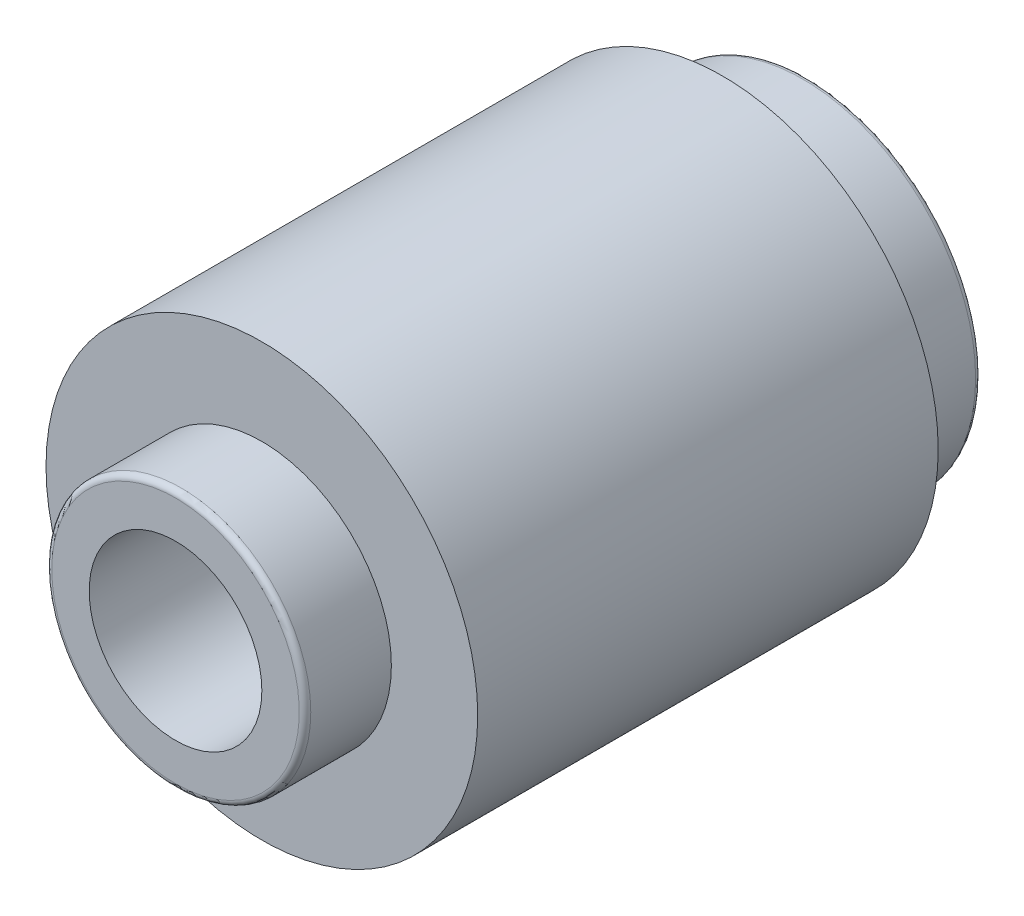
ISO-10303-21;
HEADER;
FILE_DESCRIPTION(('STEP AP214'),'2;1');
FILE_NAME('part.step','',(''),(''),'','','');
FILE_SCHEMA(('AUTOMOTIVE_DESIGN { 1 0 10303 214 1 1 1 1 }'));
ENDSEC;
DATA;
#1=APPLICATION_CONTEXT('core data for automotive mechanical design processes');
#2=APPLICATION_PROTOCOL_DEFINITION('international standard','automotive_design',2000,#1);
#3=PRODUCT_CONTEXT('',#1,'mechanical');
#4=PRODUCT('Part','Part','',(#3));
#5=PRODUCT_RELATED_PRODUCT_CATEGORY('part','',(#4));
#6=PRODUCT_DEFINITION_FORMATION('','',#4);
#7=PRODUCT_DEFINITION_CONTEXT('part definition',#1,'design');
#8=PRODUCT_DEFINITION('design','',#6,#7);
#9=PRODUCT_DEFINITION_SHAPE('','',#8);
#10=(LENGTH_UNIT() NAMED_UNIT(*) SI_UNIT(.MILLI.,.METRE.));
#11=(NAMED_UNIT(*) PLANE_ANGLE_UNIT() SI_UNIT($,.RADIAN.));
#12=(NAMED_UNIT(*) SI_UNIT($,.STERADIAN.) SOLID_ANGLE_UNIT());
#13=UNCERTAINTY_MEASURE_WITH_UNIT(LENGTH_MEASURE(1.E-05),#10,'distance_accuracy_value','');
#14=(GEOMETRIC_REPRESENTATION_CONTEXT(3) GLOBAL_UNCERTAINTY_ASSIGNED_CONTEXT((#13)) GLOBAL_UNIT_ASSIGNED_CONTEXT((#10,
#11,#12)) REPRESENTATION_CONTEXT('',''));
#15=CARTESIAN_POINT('',(0.,0.,0.));
#16=DIRECTION('',(0.,0.,1.));
#17=DIRECTION('',(1.,0.,0.));
#18=AXIS2_PLACEMENT_3D('',#15,#16,#17);
#19=CARTESIAN_POINT('',(0.,3.75,3.49252275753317));
#20=DIRECTION('',(0.,0.,-1.));
#21=DIRECTION('',(-1.,0.,0.));
#22=AXIS2_PLACEMENT_3D('',#19,#20,#21);
#23=PLANE('',#22);
#24=CARTESIAN_POINT('',(0.,0.,3.49252275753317));
#25=DIRECTION('',(0.,0.,1.));
#26=DIRECTION('',(1.,0.,0.));
#27=AXIS2_PLACEMENT_3D('',#24,#25,#26);
#28=CIRCLE('',#27,2.25);
#29=CARTESIAN_POINT('',(2.25,0.,3.49252275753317));
#30=VERTEX_POINT('',#29);
#31=EDGE_CURVE('E71',#30,#30,#28,.T.);
#32=ORIENTED_EDGE('',*,*,#31,.F.);
#33=EDGE_LOOP('',(#32));
#34=FACE_BOUND('',#33,.T.);
#35=CARTESIAN_POINT('',(0.,0.,3.49252275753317));
#36=DIRECTION('',(0.,0.,1.));
#37=DIRECTION('',(1.,0.,0.));
#38=AXIS2_PLACEMENT_3D('',#35,#36,#37);
#39=CIRCLE('',#38,3.75);
#40=CARTESIAN_POINT('',(3.75,0.,3.49252275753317));
#41=VERTEX_POINT('',#40);
#42=EDGE_CURVE('E50',#41,#41,#39,.T.);
#43=ORIENTED_EDGE('',*,*,#42,.T.);
#44=EDGE_LOOP('',(#43));
#45=FACE_BOUND('',#44,.T.);
#46=ADVANCED_FACE('F30',(#34,#45),#23,.F.);
#47=CARTESIAN_POINT('',(0.,0.,21.3614343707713));
#48=DIRECTION('',(0.,0.,1.));
#49=DIRECTION('',(1.,0.,0.));
#50=AXIS2_PLACEMENT_3D('',#47,#48,#49);
#51=CYLINDRICAL_SURFACE('',#50,3.75);
#52=ORIENTED_EDGE('',*,*,#42,.F.);
#53=EDGE_LOOP('',(#52));
#54=FACE_BOUND('',#53,.T.);
#55=CARTESIAN_POINT('',(0.,0.,-4.50747724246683));
#56=DIRECTION('',(0.,0.,1.));
#57=DIRECTION('',(1.,0.,0.));
#58=AXIS2_PLACEMENT_3D('',#55,#56,#57);
#59=CIRCLE('',#58,3.75);
#60=CARTESIAN_POINT('',(3.75,0.,-4.50747724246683));
#61=VERTEX_POINT('',#60);
#62=EDGE_CURVE('E53',#61,#61,#59,.T.);
#63=ORIENTED_EDGE('',*,*,#62,.T.);
#64=EDGE_LOOP('',(#63));
#65=FACE_BOUND('',#64,.T.);
#66=ADVANCED_FACE('F79',(#54,#65),#51,.T.);
#67=CARTESIAN_POINT('',(0.,3.75,-4.50747724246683));
#68=DIRECTION('',(0.,0.,1.));
#69=DIRECTION('',(1.,0.,0.));
#70=AXIS2_PLACEMENT_3D('',#67,#68,#69);
#71=PLANE('',#70);
#72=ORIENTED_EDGE('',*,*,#62,.F.);
#73=EDGE_LOOP('',(#72));
#74=FACE_BOUND('',#73,.T.);
#75=CARTESIAN_POINT('',(0.,0.,-4.50747724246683));
#76=DIRECTION('',(0.,0.,1.));
#77=DIRECTION('',(1.,0.,0.));
#78=AXIS2_PLACEMENT_3D('',#75,#76,#77);
#79=CIRCLE('',#78,3.);
#80=CARTESIAN_POINT('',(3.,0.,-4.50747724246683));
#81=VERTEX_POINT('',#80);
#82=EDGE_CURVE('E56',#81,#81,#79,.T.);
#83=ORIENTED_EDGE('',*,*,#82,.T.);
#84=EDGE_LOOP('',(#83));
#85=FACE_BOUND('',#84,.T.);
#86=ADVANCED_FACE('F85',(#74,#85),#71,.F.);
#87=CARTESIAN_POINT('',(0.,0.,21.3614343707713));
#88=DIRECTION('',(0.,0.,1.));
#89=DIRECTION('',(1.,0.,0.));
#90=AXIS2_PLACEMENT_3D('',#87,#88,#89);
#91=CYLINDRICAL_SURFACE('',#90,3.);
#92=CARTESIAN_POINT('',(0.,0.,-5.90747724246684));
#93=DIRECTION('',(0.,0.,1.));
#94=DIRECTION('',(1.,0.,0.));
#95=AXIS2_PLACEMENT_3D('',#92,#93,#94);
#96=CIRCLE('',#95,3.);
#97=CARTESIAN_POINT('',(3.,0.,-5.90747724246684));
#98=VERTEX_POINT('',#97);
#99=EDGE_CURVE('E45',#98,#98,#96,.T.);
#100=ORIENTED_EDGE('',*,*,#99,.T.);
#101=EDGE_LOOP('',(#100));
#102=FACE_BOUND('',#101,.T.);
#103=ORIENTED_EDGE('',*,*,#82,.F.);
#104=EDGE_LOOP('',(#103));
#105=FACE_BOUND('',#104,.T.);
#106=ADVANCED_FACE('F91',(#102,#105),#91,.T.);
#107=CARTESIAN_POINT('',(0.,3.,-6.00747724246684));
#108=DIRECTION('',(0.,0.,1.));
#109=DIRECTION('',(1.,0.,0.));
#110=AXIS2_PLACEMENT_3D('',#107,#108,#109);
#111=PLANE('',#110);
#112=CARTESIAN_POINT('',(0.,0.,-6.00747724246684));
#113=DIRECTION('',(0.,0.,1.));
#114=DIRECTION('',(1.,0.,0.));
#115=AXIS2_PLACEMENT_3D('',#112,#113,#114);
#116=CIRCLE('',#115,2.9);
#117=CARTESIAN_POINT('',(2.9,0.,-6.00747724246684));
#118=VERTEX_POINT('',#117);
#119=EDGE_CURVE('E41',#118,#118,#116,.F.);
#120=ORIENTED_EDGE('',*,*,#119,.T.);
#121=EDGE_LOOP('',(#120));
#122=FACE_BOUND('',#121,.T.);
#123=CARTESIAN_POINT('',(0.,0.,-6.00747724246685));
#124=DIRECTION('',(0.,0.,1.));
#125=DIRECTION('',(1.,0.,0.));
#126=AXIS2_PLACEMENT_3D('',#123,#124,#125);
#127=CIRCLE('',#126,2.25000000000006);
#128=CARTESIAN_POINT('',(2.25000000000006,0.,-6.00747724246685));
#129=VERTEX_POINT('',#128);
#130=EDGE_CURVE('E59',#129,#129,#127,.T.);
#131=ORIENTED_EDGE('',*,*,#130,.T.);
#132=EDGE_LOOP('',(#131));
#133=FACE_BOUND('',#132,.T.);
#134=ADVANCED_FACE('F96',(#122,#133),#111,.F.);
#135=CARTESIAN_POINT('',(0.,0.,21.3614343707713));
#136=DIRECTION('',(0.,0.,1.));
#137=DIRECTION('',(1.,0.,0.));
#138=AXIS2_PLACEMENT_3D('',#135,#136,#137);
#139=CYLINDRICAL_SURFACE('',#138,2.25000000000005);
#140=ORIENTED_EDGE('',*,*,#130,.F.);
#141=EDGE_LOOP('',(#140));
#142=FACE_BOUND('',#141,.T.);
#143=CARTESIAN_POINT('',(0.,0.,2.49252275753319));
#144=DIRECTION('',(0.,0.,1.));
#145=DIRECTION('',(1.,0.,0.));
#146=AXIS2_PLACEMENT_3D('',#143,#144,#145);
#147=CIRCLE('',#146,2.25000000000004);
#148=CARTESIAN_POINT('',(2.25000000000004,0.,2.49252275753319));
#149=VERTEX_POINT('',#148);
#150=EDGE_CURVE('E62',#149,#149,#147,.T.);
#151=ORIENTED_EDGE('',*,*,#150,.T.);
#152=EDGE_LOOP('',(#151));
#153=FACE_BOUND('',#152,.T.);
#154=ADVANCED_FACE('F102',(#142,#153),#139,.F.);
#155=CARTESIAN_POINT('',(0.,1.5,2.49252275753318));
#156=DIRECTION('',(0.,0.,1.));
#157=DIRECTION('',(1.,0.,0.));
#158=AXIS2_PLACEMENT_3D('',#155,#156,#157);
#159=PLANE('',#158);
#160=ORIENTED_EDGE('',*,*,#150,.F.);
#161=EDGE_LOOP('',(#160));
#162=FACE_BOUND('',#161,.T.);
#163=CARTESIAN_POINT('',(0.,0.,2.49252275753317));
#164=DIRECTION('',(0.,0.,1.));
#165=DIRECTION('',(1.,0.,0.));
#166=AXIS2_PLACEMENT_3D('',#163,#164,#165);
#167=CIRCLE('',#166,1.5);
#168=CARTESIAN_POINT('',(1.5,0.,2.49252275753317));
#169=VERTEX_POINT('',#168);
#170=EDGE_CURVE('E65',#169,#169,#167,.T.);
#171=ORIENTED_EDGE('',*,*,#170,.T.);
#172=EDGE_LOOP('',(#171));
#173=FACE_BOUND('',#172,.T.);
#174=ADVANCED_FACE('F124',(#162,#173),#159,.F.);
#175=CARTESIAN_POINT('',(0.,0.,21.3614343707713));
#176=DIRECTION('',(0.,0.,1.));
#177=DIRECTION('',(1.,0.,0.));
#178=AXIS2_PLACEMENT_3D('',#175,#176,#177);
#179=CYLINDRICAL_SURFACE('',#178,1.5);
#180=ORIENTED_EDGE('',*,*,#170,.F.);
#181=EDGE_LOOP('',(#180));
#182=FACE_BOUND('',#181,.T.);
#183=CARTESIAN_POINT('',(0.,0.,4.99252275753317));
#184=DIRECTION('',(0.,0.,1.));
#185=DIRECTION('',(1.,0.,0.));
#186=AXIS2_PLACEMENT_3D('',#183,#184,#185);
#187=CIRCLE('',#186,1.5);
#188=CARTESIAN_POINT('',(1.5,0.,4.99252275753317));
#189=VERTEX_POINT('',#188);
#190=EDGE_CURVE('E68',#189,#189,#187,.T.);
#191=ORIENTED_EDGE('',*,*,#190,.T.);
#192=EDGE_LOOP('',(#191));
#193=FACE_BOUND('',#192,.T.);
#194=ADVANCED_FACE('F129',(#182,#193),#179,.F.);
#195=CARTESIAN_POINT('',(0.,2.25,4.99252275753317));
#196=DIRECTION('',(0.,0.,-1.));
#197=DIRECTION('',(-1.,0.,0.));
#198=AXIS2_PLACEMENT_3D('',#195,#196,#197);
#199=PLANE('',#198);
#200=CARTESIAN_POINT('',(0.,0.,4.99252275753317));
#201=DIRECTION('',(0.,0.,-1.));
#202=DIRECTION('',(-1.,0.,0.));
#203=AXIS2_PLACEMENT_3D('',#200,#201,#202);
#204=CIRCLE('',#203,2.15);
#205=CARTESIAN_POINT('',(-2.15,0.,4.99252275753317));
#206=VERTEX_POINT('',#205);
#207=EDGE_CURVE('E37',#206,#206,#204,.F.);
#208=ORIENTED_EDGE('',*,*,#207,.T.);
#209=EDGE_LOOP('',(#208));
#210=FACE_BOUND('',#209,.T.);
#211=ORIENTED_EDGE('',*,*,#190,.F.);
#212=EDGE_LOOP('',(#211));
#213=FACE_BOUND('',#212,.T.);
#214=ADVANCED_FACE('F114',(#210,#213),#199,.F.);
#215=CARTESIAN_POINT('',(0.,0.,21.3614343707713));
#216=DIRECTION('',(0.,0.,1.));
#217=DIRECTION('',(1.,0.,0.));
#218=AXIS2_PLACEMENT_3D('',#215,#216,#217);
#219=CYLINDRICAL_SURFACE('',#218,2.25);
#220=CARTESIAN_POINT('',(0.,0.,4.89252275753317));
#221=DIRECTION('',(0.,0.,-1.));
#222=DIRECTION('',(-1.,0.,0.));
#223=AXIS2_PLACEMENT_3D('',#220,#221,#222);
#224=CIRCLE('',#223,2.25);
#225=CARTESIAN_POINT('',(-2.25,0.,4.89252275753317));
#226=VERTEX_POINT('',#225);
#227=EDGE_CURVE('E10',#226,#226,#224,.T.);
#228=ORIENTED_EDGE('',*,*,#227,.T.);
#229=EDGE_LOOP('',(#228));
#230=FACE_BOUND('',#229,.T.);
#231=ORIENTED_EDGE('',*,*,#31,.T.);
#232=EDGE_LOOP('',(#231));
#233=FACE_BOUND('',#232,.T.);
#234=ADVANCED_FACE('F75',(#230,#233),#219,.T.);
#235=CARTESIAN_POINT('',(0.,0.,-5.90747724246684));
#236=DIRECTION('',(0.,0.,1.));
#237=DIRECTION('',(1.,0.,0.));
#238=AXIS2_PLACEMENT_3D('',#235,#236,#237);
#239=TOROIDAL_SURFACE('',#238,2.9,0.1);
#240=ORIENTED_EDGE('',*,*,#119,.F.);
#241=EDGE_LOOP('',(#240));
#242=FACE_BOUND('',#241,.T.);
#243=ORIENTED_EDGE('',*,*,#99,.F.);
#244=EDGE_LOOP('',(#243));
#245=FACE_BOUND('',#244,.T.);
#246=ADVANCED_FACE('F106',(#242,#245),#239,.T.);
#247=CARTESIAN_POINT('',(0.,0.,4.89252275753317));
#248=DIRECTION('',(0.,0.,-1.));
#249=DIRECTION('',(-1.,0.,0.));
#250=AXIS2_PLACEMENT_3D('',#247,#248,#249);
#251=TOROIDAL_SURFACE('',#250,2.15,0.1);
#252=ORIENTED_EDGE('',*,*,#227,.F.);
#253=EDGE_LOOP('',(#252));
#254=FACE_BOUND('',#253,.T.);
#255=ORIENTED_EDGE('',*,*,#207,.F.);
#256=EDGE_LOOP('',(#255));
#257=FACE_BOUND('',#256,.T.);
#258=ADVANCED_FACE('F32',(#254,#257),#251,.T.);
#259=CLOSED_SHELL('',(#46,#66,#86,#106,#134,#154,#174,#194,#214,#234,#246,#258));
#260=MANIFOLD_SOLID_BREP('B2',#259);
#261=ADVANCED_BREP_SHAPE_REPRESENTATION('',(#18,#260),#14);
#262=SHAPE_DEFINITION_REPRESENTATION(#9,#261);
ENDSEC;
END-ISO-10303-21;
